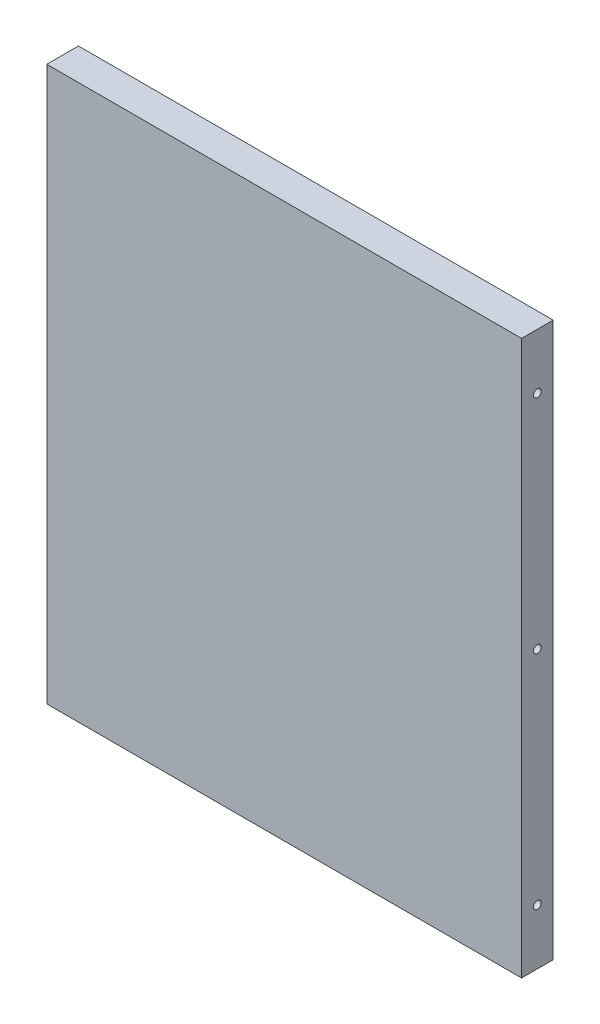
from build123d import *

# Parameters (mm, degrees)
SKIZZE1_W                       = 150
SKIZZE1_H                       = 175
AUFSATZ_LINEAR_AUSTRAGEN1_DEPTH = 10
SKIZZE2_R                       = 1.25
SKIZZE2_R_2                     = 1.23
SCHNITT_LINEAR_AUSTRAGEN1_DEPTH = 5
SCHNITT_LINEAR_START            = -5
SKIZZE3_R                       = 1.23
SCHNITT_LINEAR_AUSTRAGEN2_DEPTH = 5


with BuildPart() as part:
    # Skizze1 → Aufsatz-Linear austragen1 (new body)
    with BuildSketch(Plane.XY):
        with Locations((-9.70090245, -21.923076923)):
            Rectangle(SKIZZE1_W, SKIZZE1_H)
    extrude(amount=AUFSATZ_LINEAR_AUSTRAGEN1_DEPTH)

    # Skizze2 → Schnitt-Linear austragen1 (cut)
    with BuildSketch(Plane.ZY.offset(84.70090245)):
        with Locations(Location((5, 48.076923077, 0), (0, 0, 270))):
            Circle(SKIZZE2_R)
        with Locations(Location((5, -21.923076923, 0), (0, 0, 270))):
            Circle(SKIZZE2_R)
        with Locations(Location((5, -91.923076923, 0), (0, 0, 270))):
            Circle(SKIZZE2_R_2)
    extrude(amount=-SCHNITT_LINEAR_AUSTRAGEN1_DEPTH, mode=Mode.SUBTRACT)

    # Skizze3 → Schnitt-Linear austragen2 (cut)
    with BuildSketch(Plane(origin=(65.29909755, 0, 0), x_dir=(0, 0, -1), z_dir=(1, 0, 0)).offset(SCHNITT_LINEAR_START)):
        with Locations(Location((-5, 48.076923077, 0), (0, 0, 90))):
            Circle(SKIZZE3_R)
        with Locations(Location((-5, -21.923076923, 0), (0, 0, 90))):
            Circle(SKIZZE3_R)
        with Locations(Location((-5, -91.923076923, 0), (0, 0, 270))):
            Circle(SKIZZE3_R)
    extrude(amount=SCHNITT_LINEAR_AUSTRAGEN2_DEPTH, mode=Mode.SUBTRACT)


solid = part.part
